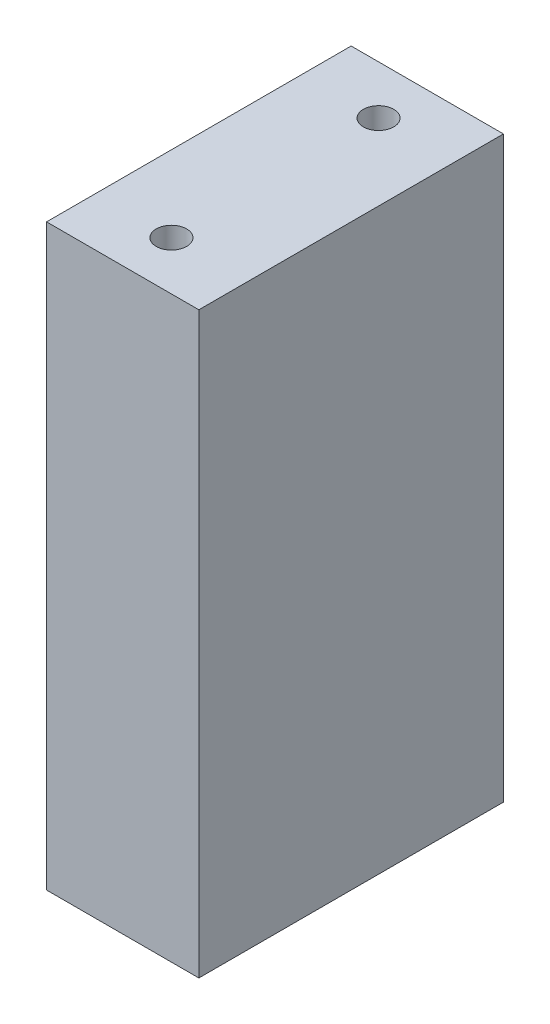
ISO-10303-21;
HEADER;
FILE_DESCRIPTION(('STEP AP214'),'2;1');
FILE_NAME('part.step','',(''),(''),'','','');
FILE_SCHEMA(('AUTOMOTIVE_DESIGN { 1 0 10303 214 1 1 1 1 }'));
ENDSEC;
DATA;
#1=APPLICATION_CONTEXT('core data for automotive mechanical design processes');
#2=APPLICATION_PROTOCOL_DEFINITION('international standard','automotive_design',2000,#1);
#3=PRODUCT_CONTEXT('',#1,'mechanical');
#4=PRODUCT('Part','Part','',(#3));
#5=PRODUCT_RELATED_PRODUCT_CATEGORY('part','',(#4));
#6=PRODUCT_DEFINITION_FORMATION('','',#4);
#7=PRODUCT_DEFINITION_CONTEXT('part definition',#1,'design');
#8=PRODUCT_DEFINITION('design','',#6,#7);
#9=PRODUCT_DEFINITION_SHAPE('','',#8);
#10=(LENGTH_UNIT() NAMED_UNIT(*) SI_UNIT(.MILLI.,.METRE.));
#11=(NAMED_UNIT(*) PLANE_ANGLE_UNIT() SI_UNIT($,.RADIAN.));
#12=(NAMED_UNIT(*) SI_UNIT($,.STERADIAN.) SOLID_ANGLE_UNIT());
#13=UNCERTAINTY_MEASURE_WITH_UNIT(LENGTH_MEASURE(1.E-05),#10,'distance_accuracy_value','');
#14=(GEOMETRIC_REPRESENTATION_CONTEXT(3) GLOBAL_UNCERTAINTY_ASSIGNED_CONTEXT((#13)) GLOBAL_UNIT_ASSIGNED_CONTEXT((#10,
#11,#12)) REPRESENTATION_CONTEXT('',''));
#15=CARTESIAN_POINT('',(0.,0.,0.));
#16=DIRECTION('',(0.,0.,1.));
#17=DIRECTION('',(1.,0.,0.));
#18=AXIS2_PLACEMENT_3D('',#15,#16,#17);
#19=CARTESIAN_POINT('',(0.,77.999999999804,-17.));
#20=DIRECTION('',(0.,1.,0.));
#21=DIRECTION('',(0.,0.,1.));
#22=AXIS2_PLACEMENT_3D('',#19,#20,#21);
#23=CONICAL_SURFACE('',#22,2.49999999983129,1.02974425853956);
#24=CARTESIAN_POINT('',(0.,76.4978484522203,-17.));
#25=VERTEX_POINT('',#24);
#26=VERTEX_LOOP('',#25);
#27=FACE_BOUND('',#26,.T.);
#28=CARTESIAN_POINT('',(0.,78.,-17.));
#29=DIRECTION('',(0.,1.,0.));
#30=DIRECTION('',(0.,0.,1.));
#31=AXIS2_PLACEMENT_3D('',#28,#29,#30);
#32=CIRCLE('',#31,2.49999999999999);
#33=CARTESIAN_POINT('',(0.,78.,-14.5));
#34=VERTEX_POINT('',#33);
#35=EDGE_CURVE('E72',#34,#34,#32,.T.);
#36=ORIENTED_EDGE('',*,*,#35,.T.);
#37=EDGE_LOOP('',(#36));
#38=FACE_BOUND('',#37,.T.);
#39=ADVANCED_FACE('F17',(#27,#38),#23,.F.);
#40=CARTESIAN_POINT('',(0.,77.9999999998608,17.));
#41=DIRECTION('',(0.,1.,0.));
#42=DIRECTION('',(0.,0.,1.));
#43=AXIS2_PLACEMENT_3D('',#40,#41,#42);
#44=CONICAL_SURFACE('',#43,2.49999999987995,1.02974425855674);
#45=CARTESIAN_POINT('',(0.,76.4978484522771,17.));
#46=VERTEX_POINT('',#45);
#47=VERTEX_LOOP('',#46);
#48=FACE_BOUND('',#47,.T.);
#49=CARTESIAN_POINT('',(0.,78.,17.));
#50=DIRECTION('',(0.,1.,0.));
#51=DIRECTION('',(0.,0.,1.));
#52=AXIS2_PLACEMENT_3D('',#49,#50,#51);
#53=CIRCLE('',#52,2.49999999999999);
#54=CARTESIAN_POINT('',(0.,78.,19.5));
#55=VERTEX_POINT('',#54);
#56=EDGE_CURVE('E74',#55,#55,#53,.T.);
#57=ORIENTED_EDGE('',*,*,#56,.T.);
#58=EDGE_LOOP('',(#57));
#59=FACE_BOUND('',#58,.T.);
#60=ADVANCED_FACE('F69',(#48,#59),#44,.F.);
#61=CARTESIAN_POINT('',(6.,17.0000000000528,17.));
#62=DIRECTION('',(0.,-1.,0.));
#63=DIRECTION('',(0.,0.,-1.));
#64=AXIS2_PLACEMENT_3D('',#61,#62,#63);
#65=CONICAL_SURFACE('',#64,2.49999999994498,1.02974425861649);
#66=CARTESIAN_POINT('',(6.,18.5021515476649,17.0000000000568));
#67=VERTEX_POINT('',#66);
#68=VERTEX_LOOP('',#67);
#69=FACE_BOUND('',#68,.T.);
#70=CARTESIAN_POINT('',(6.,17.,17.));
#71=DIRECTION('',(0.,-1.,0.));
#72=DIRECTION('',(0.,0.,-1.));
#73=AXIS2_PLACEMENT_3D('',#70,#71,#72);
#74=CIRCLE('',#73,2.49999999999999);
#75=CARTESIAN_POINT('',(6.,17.,14.5));
#76=VERTEX_POINT('',#75);
#77=EDGE_CURVE('E77',#76,#76,#74,.T.);
#78=ORIENTED_EDGE('',*,*,#77,.T.);
#79=EDGE_LOOP('',(#78));
#80=FACE_BOUND('',#79,.T.);
#81=ADVANCED_FACE('F110',(#69,#80),#65,.F.);
#82=CARTESIAN_POINT('',(6.,16.9999999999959,-17.));
#83=DIRECTION('',(0.,-1.,0.));
#84=DIRECTION('',(0.,0.,-1.));
#85=AXIS2_PLACEMENT_3D('',#82,#83,#84);
#86=CONICAL_SURFACE('',#85,2.50000000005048,1.02974425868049);
#87=CARTESIAN_POINT('',(6.,18.5021515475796,-17.));
#88=VERTEX_POINT('',#87);
#89=VERTEX_LOOP('',#88);
#90=FACE_BOUND('',#89,.T.);
#91=CARTESIAN_POINT('',(6.,17.,-17.));
#92=DIRECTION('',(0.,-1.,0.));
#93=DIRECTION('',(0.,0.,-1.));
#94=AXIS2_PLACEMENT_3D('',#91,#92,#93);
#95=CIRCLE('',#94,2.49999999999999);
#96=CARTESIAN_POINT('',(6.,17.,-19.5));
#97=VERTEX_POINT('',#96);
#98=EDGE_CURVE('E99',#97,#97,#95,.T.);
#99=ORIENTED_EDGE('',*,*,#98,.T.);
#100=EDGE_LOOP('',(#99));
#101=FACE_BOUND('',#100,.T.);
#102=ADVANCED_FACE('F157',(#90,#101),#86,.F.);
#103=CARTESIAN_POINT('',(0.,95.,-17.));
#104=DIRECTION('',(0.,1.,0.));
#105=DIRECTION('',(0.,0.,1.));
#106=AXIS2_PLACEMENT_3D('',#103,#104,#105);
#107=CYLINDRICAL_SURFACE('',#106,2.49999999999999);
#108=CARTESIAN_POINT('',(0.,95.,-17.));
#109=DIRECTION('',(0.,1.,0.));
#110=DIRECTION('',(0.,0.,1.));
#111=AXIS2_PLACEMENT_3D('',#108,#109,#110);
#112=CIRCLE('',#111,2.49999999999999);
#113=CARTESIAN_POINT('',(0.,95.,-14.5));
#114=VERTEX_POINT('',#113);
#115=EDGE_CURVE('E20',#114,#114,#112,.F.);
#116=ORIENTED_EDGE('',*,*,#115,.F.);
#117=EDGE_LOOP('',(#116));
#118=FACE_BOUND('',#117,.T.);
#119=ORIENTED_EDGE('',*,*,#35,.F.);
#120=EDGE_LOOP('',(#119));
#121=FACE_BOUND('',#120,.T.);
#122=ADVANCED_FACE('F153',(#118,#121),#107,.F.);
#123=CARTESIAN_POINT('',(0.,95.,17.));
#124=DIRECTION('',(0.,1.,0.));
#125=DIRECTION('',(0.,0.,1.));
#126=AXIS2_PLACEMENT_3D('',#123,#124,#125);
#127=CYLINDRICAL_SURFACE('',#126,2.49999999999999);
#128=CARTESIAN_POINT('',(0.,95.,17.));
#129=DIRECTION('',(0.,1.,0.));
#130=DIRECTION('',(0.,0.,1.));
#131=AXIS2_PLACEMENT_3D('',#128,#129,#130);
#132=CIRCLE('',#131,2.49999999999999);
#133=CARTESIAN_POINT('',(0.,95.,19.5));
#134=VERTEX_POINT('',#133);
#135=EDGE_CURVE('E87',#134,#134,#132,.F.);
#136=ORIENTED_EDGE('',*,*,#135,.F.);
#137=EDGE_LOOP('',(#136));
#138=FACE_BOUND('',#137,.T.);
#139=ORIENTED_EDGE('',*,*,#56,.F.);
#140=EDGE_LOOP('',(#139));
#141=FACE_BOUND('',#140,.T.);
#142=ADVANCED_FACE('F116',(#138,#141),#127,.F.);
#143=CARTESIAN_POINT('',(6.,0.,17.));
#144=DIRECTION('',(0.,-1.,0.));
#145=DIRECTION('',(0.,0.,-1.));
#146=AXIS2_PLACEMENT_3D('',#143,#144,#145);
#147=CYLINDRICAL_SURFACE('',#146,2.49999999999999);
#148=ORIENTED_EDGE('',*,*,#77,.F.);
#149=EDGE_LOOP('',(#148));
#150=FACE_BOUND('',#149,.T.);
#151=CARTESIAN_POINT('',(6.,0.,17.));
#152=DIRECTION('',(0.,-1.,0.));
#153=DIRECTION('',(0.,0.,-1.));
#154=AXIS2_PLACEMENT_3D('',#151,#152,#153);
#155=CIRCLE('',#154,2.49999999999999);
#156=CARTESIAN_POINT('',(6.,0.,14.5));
#157=VERTEX_POINT('',#156);
#158=EDGE_CURVE('E84',#157,#157,#155,.T.);
#159=ORIENTED_EDGE('',*,*,#158,.T.);
#160=EDGE_LOOP('',(#159));
#161=FACE_BOUND('',#160,.T.);
#162=ADVANCED_FACE('F112',(#150,#161),#147,.F.);
#163=CARTESIAN_POINT('',(6.,0.,-17.));
#164=DIRECTION('',(0.,-1.,0.));
#165=DIRECTION('',(0.,0.,-1.));
#166=AXIS2_PLACEMENT_3D('',#163,#164,#165);
#167=CYLINDRICAL_SURFACE('',#166,2.49999999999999);
#168=ORIENTED_EDGE('',*,*,#98,.F.);
#169=EDGE_LOOP('',(#168));
#170=FACE_BOUND('',#169,.T.);
#171=CARTESIAN_POINT('',(6.,0.,-17.));
#172=DIRECTION('',(0.,-1.,0.));
#173=DIRECTION('',(0.,0.,-1.));
#174=AXIS2_PLACEMENT_3D('',#171,#172,#173);
#175=CIRCLE('',#174,2.49999999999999);
#176=CARTESIAN_POINT('',(6.,0.,-19.5));
#177=VERTEX_POINT('',#176);
#178=EDGE_CURVE('E81',#177,#177,#175,.T.);
#179=ORIENTED_EDGE('',*,*,#178,.T.);
#180=EDGE_LOOP('',(#179));
#181=FACE_BOUND('',#180,.T.);
#182=ADVANCED_FACE('F115',(#170,#181),#167,.F.);
#183=CARTESIAN_POINT('',(-12.5,95.,-25.));
#184=DIRECTION('',(1.,0.,0.));
#185=DIRECTION('',(0.,0.,-1.));
#186=AXIS2_PLACEMENT_3D('',#183,#184,#185);
#187=PLANE('',#186);
#188=DIRECTION('',(0.,1.,0.));
#189=VECTOR('',#188,1.);
#190=CARTESIAN_POINT('',(-12.5,95.,25.));
#191=LINE('',#190,#189);
#192=CARTESIAN_POINT('',(-12.5,0.,25.));
#193=VERTEX_POINT('',#192);
#194=CARTESIAN_POINT('',(-12.5,95.,25.));
#195=VERTEX_POINT('',#194);
#196=EDGE_CURVE('E95',#193,#195,#191,.T.);
#197=ORIENTED_EDGE('',*,*,#196,.T.);
#198=DIRECTION('',(0.,0.,1.));
#199=VECTOR('',#198,1.);
#200=CARTESIAN_POINT('',(-12.5,95.,0.));
#201=LINE('',#200,#199);
#202=CARTESIAN_POINT('',(-12.5,95.,-25.));
#203=VERTEX_POINT('',#202);
#204=EDGE_CURVE('E89',#203,#195,#201,.T.);
#205=ORIENTED_EDGE('',*,*,#204,.F.);
#206=DIRECTION('',(0.,1.,0.));
#207=VECTOR('',#206,1.);
#208=CARTESIAN_POINT('',(-12.5,95.,-25.));
#209=LINE('',#208,#207);
#210=CARTESIAN_POINT('',(-12.5,0.,-25.));
#211=VERTEX_POINT('',#210);
#212=EDGE_CURVE('E86',#203,#211,#209,.F.);
#213=ORIENTED_EDGE('',*,*,#212,.T.);
#214=DIRECTION('',(0.,0.,1.));
#215=VECTOR('',#214,1.);
#216=CARTESIAN_POINT('',(-12.5,0.,0.));
#217=LINE('',#216,#215);
#218=EDGE_CURVE('E305',#211,#193,#217,.T.);
#219=ORIENTED_EDGE('',*,*,#218,.T.);
#220=EDGE_LOOP('',(#197,#205,#213,#219));
#221=FACE_BOUND('',#220,.T.);
#222=ADVANCED_FACE('F144',(#221),#187,.F.);
#223=CARTESIAN_POINT('',(-12.5,95.,25.));
#224=DIRECTION('',(0.,0.,-1.));
#225=DIRECTION('',(-1.,0.,0.));
#226=AXIS2_PLACEMENT_3D('',#223,#224,#225);
#227=PLANE('',#226);
#228=DIRECTION('',(0.,1.,0.));
#229=VECTOR('',#228,1.);
#230=CARTESIAN_POINT('',(12.5,95.,25.));
#231=LINE('',#230,#229);
#232=CARTESIAN_POINT('',(12.5,0.,25.));
#233=VERTEX_POINT('',#232);
#234=CARTESIAN_POINT('',(12.5,95.,25.));
#235=VERTEX_POINT('',#234);
#236=EDGE_CURVE('E298',#233,#235,#231,.T.);
#237=ORIENTED_EDGE('',*,*,#236,.T.);
#238=DIRECTION('',(1.,0.,0.));
#239=VECTOR('',#238,1.);
#240=CARTESIAN_POINT('',(0.,95.,25.));
#241=LINE('',#240,#239);
#242=EDGE_CURVE('E92',#195,#235,#241,.T.);
#243=ORIENTED_EDGE('',*,*,#242,.F.);
#244=ORIENTED_EDGE('',*,*,#196,.F.);
#245=DIRECTION('',(1.,0.,0.));
#246=VECTOR('',#245,1.);
#247=CARTESIAN_POINT('',(0.,0.,25.));
#248=LINE('',#247,#246);
#249=EDGE_CURVE('E299',#193,#233,#248,.T.);
#250=ORIENTED_EDGE('',*,*,#249,.T.);
#251=EDGE_LOOP('',(#237,#243,#244,#250));
#252=FACE_BOUND('',#251,.T.);
#253=ADVANCED_FACE('F140',(#252),#227,.F.);
#254=CARTESIAN_POINT('',(0.,95.,0.));
#255=DIRECTION('',(0.,1.,0.));
#256=DIRECTION('',(0.,0.,1.));
#257=AXIS2_PLACEMENT_3D('',#254,#255,#256);
#258=PLANE('',#257);
#259=ORIENTED_EDGE('',*,*,#204,.T.);
#260=ORIENTED_EDGE('',*,*,#242,.T.);
#261=DIRECTION('',(0.,0.,1.));
#262=VECTOR('',#261,1.);
#263=CARTESIAN_POINT('',(12.5,95.,-25.));
#264=LINE('',#263,#262);
#265=CARTESIAN_POINT('',(12.5,95.,-25.));
#266=VERTEX_POINT('',#265);
#267=EDGE_CURVE('E301',#235,#266,#264,.F.);
#268=ORIENTED_EDGE('',*,*,#267,.T.);
#269=DIRECTION('',(1.,0.,0.));
#270=VECTOR('',#269,1.);
#271=CARTESIAN_POINT('',(-12.5,95.,-25.));
#272=LINE('',#271,#270);
#273=EDGE_CURVE('E312',#266,#203,#272,.F.);
#274=ORIENTED_EDGE('',*,*,#273,.T.);
#275=EDGE_LOOP('',(#259,#260,#268,#274));
#276=FACE_BOUND('',#275,.T.);
#277=ORIENTED_EDGE('',*,*,#135,.T.);
#278=EDGE_LOOP('',(#277));
#279=FACE_BOUND('',#278,.T.);
#280=ORIENTED_EDGE('',*,*,#115,.T.);
#281=EDGE_LOOP('',(#280));
#282=FACE_BOUND('',#281,.T.);
#283=ADVANCED_FACE('F132',(#276,#279,#282),#258,.T.);
#284=CARTESIAN_POINT('',(-12.5,95.,-25.));
#285=DIRECTION('',(0.,0.,1.));
#286=DIRECTION('',(1.,0.,0.));
#287=AXIS2_PLACEMENT_3D('',#284,#285,#286);
#288=PLANE('',#287);
#289=ORIENTED_EDGE('',*,*,#212,.F.);
#290=ORIENTED_EDGE('',*,*,#273,.F.);
#291=DIRECTION('',(0.,1.,0.));
#292=VECTOR('',#291,1.);
#293=CARTESIAN_POINT('',(12.5,95.,-25.));
#294=LINE('',#293,#292);
#295=CARTESIAN_POINT('',(12.5,0.,-25.));
#296=VERTEX_POINT('',#295);
#297=EDGE_CURVE('E26',#266,#296,#294,.F.);
#298=ORIENTED_EDGE('',*,*,#297,.T.);
#299=DIRECTION('',(1.,0.,0.));
#300=VECTOR('',#299,1.);
#301=CARTESIAN_POINT('',(0.,0.,-25.));
#302=LINE('',#301,#300);
#303=EDGE_CURVE('E34',#296,#211,#302,.F.);
#304=ORIENTED_EDGE('',*,*,#303,.T.);
#305=EDGE_LOOP('',(#289,#290,#298,#304));
#306=FACE_BOUND('',#305,.T.);
#307=ADVANCED_FACE('F123',(#306),#288,.F.);
#308=CARTESIAN_POINT('',(0.,0.,0.));
#309=DIRECTION('',(0.,1.,0.));
#310=DIRECTION('',(0.,0.,1.));
#311=AXIS2_PLACEMENT_3D('',#308,#309,#310);
#312=PLANE('',#311);
#313=ORIENTED_EDGE('',*,*,#249,.F.);
#314=ORIENTED_EDGE('',*,*,#218,.F.);
#315=ORIENTED_EDGE('',*,*,#303,.F.);
#316=DIRECTION('',(0.,0.,1.));
#317=VECTOR('',#316,1.);
#318=CARTESIAN_POINT('',(12.5,0.,-25.));
#319=LINE('',#318,#317);
#320=EDGE_CURVE('E11',#296,#233,#319,.T.);
#321=ORIENTED_EDGE('',*,*,#320,.T.);
#322=EDGE_LOOP('',(#313,#314,#315,#321));
#323=FACE_BOUND('',#322,.T.);
#324=ORIENTED_EDGE('',*,*,#178,.F.);
#325=EDGE_LOOP('',(#324));
#326=FACE_BOUND('',#325,.T.);
#327=ORIENTED_EDGE('',*,*,#158,.F.);
#328=EDGE_LOOP('',(#327));
#329=FACE_BOUND('',#328,.T.);
#330=ADVANCED_FACE('F120',(#323,#326,#329),#312,.F.);
#331=CARTESIAN_POINT('',(12.5,95.,-25.));
#332=DIRECTION('',(-1.,0.,0.));
#333=DIRECTION('',(0.,0.,1.));
#334=AXIS2_PLACEMENT_3D('',#331,#332,#333);
#335=PLANE('',#334);
#336=ORIENTED_EDGE('',*,*,#297,.F.);
#337=ORIENTED_EDGE('',*,*,#267,.F.);
#338=ORIENTED_EDGE('',*,*,#236,.F.);
#339=ORIENTED_EDGE('',*,*,#320,.F.);
#340=EDGE_LOOP('',(#336,#337,#338,#339));
#341=FACE_BOUND('',#340,.T.);
#342=ADVANCED_FACE('F122',(#341),#335,.F.);
#343=CLOSED_SHELL('',(#39,#60,#81,#102,#122,#142,#162,#182,#222,#253,#283,#307,#330,#342));
#344=MANIFOLD_SOLID_BREP('B1',#343);
#345=ADVANCED_BREP_SHAPE_REPRESENTATION('',(#18,#344),#14);
#346=SHAPE_DEFINITION_REPRESENTATION(#9,#345);
ENDSEC;
END-ISO-10303-21;
